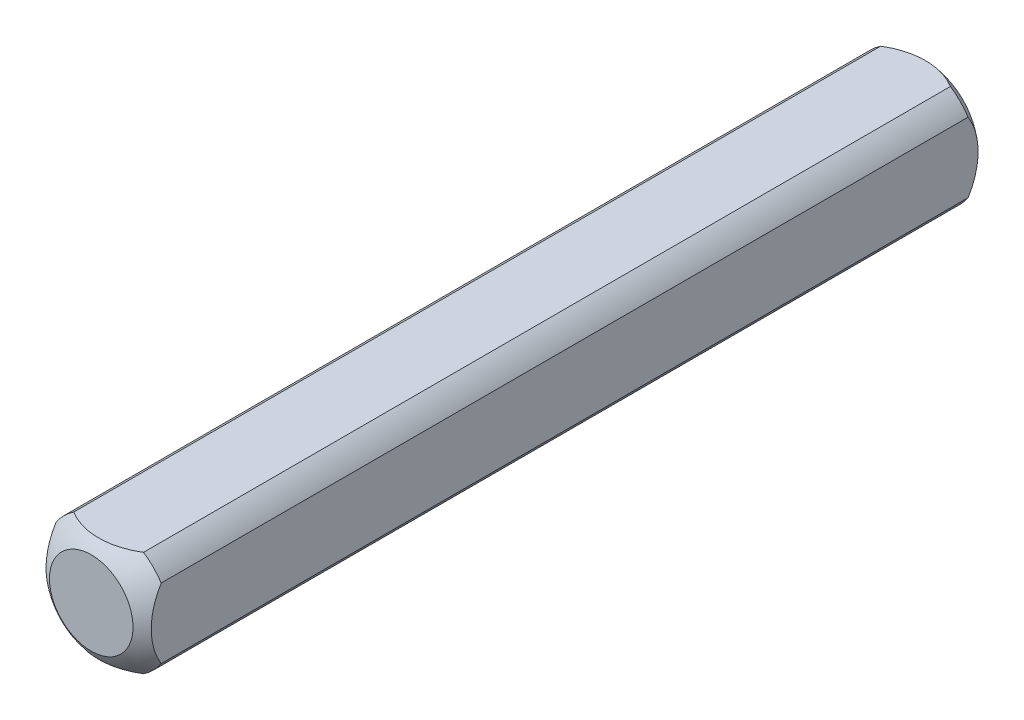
from build123d import *

# Parameters (mm, degrees)
SKETCH1_W           = 6.35
SKETCH1_H           = 6.35
BOSS_EXTRUDE1_DEPTH = 25.4
SKETCH2_OUTSIDE_W   = 13.738
SKETCH2_OUTSIDE_H   = 13.738
SKETCH2_OUTSIDE_R   = 3.81
CUT_EXTRUDE1_DEPTH  = 26.793821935


with BuildPart() as part:
    # Sketch1 → Boss-Extrude1 (new body)
    with BuildSketch(Plane.XY):
        Rectangle(SKETCH1_W, SKETCH1_H)
    extrude(amount=BOSS_EXTRUDE1_DEPTH)

    # Sketch2 outside → Cut-Extrude1 (cut, through all)
    with BuildSketch(Plane(origin=(0, 0, 0), x_dir=(-1, 0, 0), z_dir=(0, 0, -1))):
        Rectangle(SKETCH2_OUTSIDE_W, SKETCH2_OUTSIDE_H)
        Circle(SKETCH2_OUTSIDE_R, mode=Mode.SUBTRACT)
    extrude(amount=-CUT_EXTRUDE1_DEPTH, mode=Mode.SUBTRACT)

    # Sketch3 → Cut-Revolve1 (revolve, cut)
    with BuildSketch(Plane(origin=(0, 0, 0), x_dir=(1, 0, 0), z_dir=(0, 1, 0))):
        with BuildLine():
            Line((-5.053685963, -3.893335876), (-5.053685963, 5.740530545))
            Line((-5.053685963, 5.740530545), (0, 5.740530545))
            Line((0, 5.740530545), (0, 0.670274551))
            ThreePointArc((0, 0.670274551), (-3.404639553, -0.639469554), (-5.053685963, -3.893335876))
        make_face()
    revolve(axis=Axis((0, 0, 25.4), (0, 0, -1)), mode=Mode.SUBTRACT)

    # Mirror1: part across plane


with BuildPart() as part_1:
    add(part.part)
    add(part.part.mirror(Plane(origin=(0, 0, 25.4), x_dir=(1, 0, 0), z_dir=(0, 0, -1))))


solid = part_1.part
